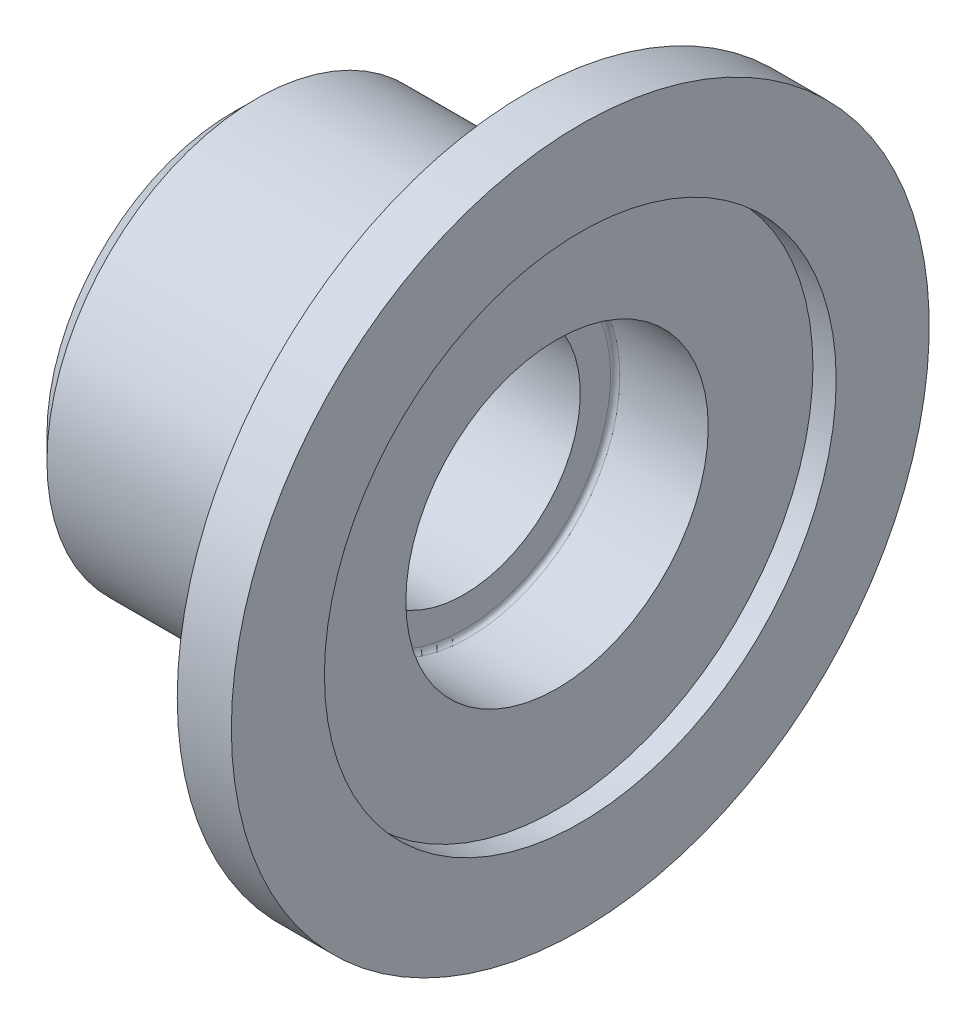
ISO-10303-21;
HEADER;
FILE_DESCRIPTION(('STEP AP214'),'2;1');
FILE_NAME('part.step','',(''),(''),'','','');
FILE_SCHEMA(('AUTOMOTIVE_DESIGN { 1 0 10303 214 1 1 1 1 }'));
ENDSEC;
DATA;
#1=APPLICATION_CONTEXT('core data for automotive mechanical design processes');
#2=APPLICATION_PROTOCOL_DEFINITION('international standard','automotive_design',2000,#1);
#3=PRODUCT_CONTEXT('',#1,'mechanical');
#4=PRODUCT('Part','Part','',(#3));
#5=PRODUCT_RELATED_PRODUCT_CATEGORY('part','',(#4));
#6=PRODUCT_DEFINITION_FORMATION('','',#4);
#7=PRODUCT_DEFINITION_CONTEXT('part definition',#1,'design');
#8=PRODUCT_DEFINITION('design','',#6,#7);
#9=PRODUCT_DEFINITION_SHAPE('','',#8);
#10=(LENGTH_UNIT() NAMED_UNIT(*) SI_UNIT(.MILLI.,.METRE.));
#11=(NAMED_UNIT(*) PLANE_ANGLE_UNIT() SI_UNIT($,.RADIAN.));
#12=(NAMED_UNIT(*) SI_UNIT($,.STERADIAN.) SOLID_ANGLE_UNIT());
#13=UNCERTAINTY_MEASURE_WITH_UNIT(LENGTH_MEASURE(1.E-05),#10,'distance_accuracy_value','');
#14=(GEOMETRIC_REPRESENTATION_CONTEXT(3) GLOBAL_UNCERTAINTY_ASSIGNED_CONTEXT((#13)) GLOBAL_UNIT_ASSIGNED_CONTEXT((#10,
#11,#12)) REPRESENTATION_CONTEXT('',''));
#15=CARTESIAN_POINT('',(0.,0.,0.));
#16=DIRECTION('',(0.,0.,1.));
#17=DIRECTION('',(1.,0.,0.));
#18=AXIS2_PLACEMENT_3D('',#15,#16,#17);
#19=CARTESIAN_POINT('',(56.0843738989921,0.,0.));
#20=DIRECTION('',(-1.,0.,0.));
#21=DIRECTION('',(0.,0.,1.));
#22=AXIS2_PLACEMENT_3D('',#19,#20,#21);
#23=TOROIDAL_SURFACE('',#22,31.4999999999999,0.999999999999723);
#24=CARTESIAN_POINT('',(55.0843738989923,0.,0.));
#25=DIRECTION('',(-1.,0.,0.));
#26=DIRECTION('',(0.,0.,1.));
#27=AXIS2_PLACEMENT_3D('',#24,#25,#26);
#28=CIRCLE('',#27,31.4999999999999);
#29=CARTESIAN_POINT('',(55.0843738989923,0.,31.4999999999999));
#30=VERTEX_POINT('',#29);
#31=EDGE_CURVE('E82',#30,#30,#28,.T.);
#32=ORIENTED_EDGE('',*,*,#31,.T.);
#33=EDGE_LOOP('',(#32));
#34=FACE_BOUND('',#33,.T.);
#35=CARTESIAN_POINT('',(56.0843738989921,0.,0.));
#36=DIRECTION('',(-1.,0.,0.));
#37=DIRECTION('',(0.,0.,1.));
#38=AXIS2_PLACEMENT_3D('',#35,#36,#37);
#39=CIRCLE('',#38,32.4999999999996);
#40=CARTESIAN_POINT('',(56.0843738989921,0.,32.4999999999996));
#41=VERTEX_POINT('',#40);
#42=EDGE_CURVE('E10',#41,#41,#39,.T.);
#43=ORIENTED_EDGE('',*,*,#42,.F.);
#44=EDGE_LOOP('',(#43));
#45=FACE_BOUND('',#44,.T.);
#46=ADVANCED_FACE('F33',(#34,#45),#23,.F.);
#47=CARTESIAN_POINT('',(0.,0.,0.));
#48=DIRECTION('',(-1.,0.,0.));
#49=DIRECTION('',(0.,0.,1.));
#50=AXIS2_PLACEMENT_3D('',#47,#48,#49);
#51=CYLINDRICAL_SURFACE('',#50,32.4999999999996);
#52=CARTESIAN_POINT('',(75.0843738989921,0.,0.));
#53=DIRECTION('',(-1.,0.,0.));
#54=DIRECTION('',(0.,0.,1.));
#55=AXIS2_PLACEMENT_3D('',#52,#53,#54);
#56=CIRCLE('',#55,32.4999999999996);
#57=CARTESIAN_POINT('',(75.0843738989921,0.,32.4999999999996));
#58=VERTEX_POINT('',#57);
#59=EDGE_CURVE('E39',#58,#58,#56,.T.);
#60=ORIENTED_EDGE('',*,*,#59,.F.);
#61=EDGE_LOOP('',(#60));
#62=FACE_BOUND('',#61,.T.);
#63=ORIENTED_EDGE('',*,*,#42,.T.);
#64=EDGE_LOOP('',(#63));
#65=FACE_BOUND('',#64,.T.);
#66=ADVANCED_FACE('F106',(#62,#65),#51,.F.);
#67=CARTESIAN_POINT('',(75.0843738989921,-29.2163034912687,0.));
#68=DIRECTION('',(-1.,0.,0.));
#69=DIRECTION('',(0.,0.,1.));
#70=AXIS2_PLACEMENT_3D('',#67,#68,#69);
#71=PLANE('',#70);
#72=CARTESIAN_POINT('',(75.0843738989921,0.,0.));
#73=DIRECTION('',(-1.,0.,0.));
#74=DIRECTION('',(0.,0.,1.));
#75=AXIS2_PLACEMENT_3D('',#72,#73,#74);
#76=CIRCLE('',#75,54.9999999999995);
#77=CARTESIAN_POINT('',(75.0843738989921,0.,54.9999999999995));
#78=VERTEX_POINT('',#77);
#79=EDGE_CURVE('E43',#78,#78,#76,.T.);
#80=ORIENTED_EDGE('',*,*,#79,.F.);
#81=EDGE_LOOP('',(#80));
#82=FACE_BOUND('',#81,.T.);
#83=ORIENTED_EDGE('',*,*,#59,.T.);
#84=EDGE_LOOP('',(#83));
#85=FACE_BOUND('',#84,.T.);
#86=ADVANCED_FACE('F110',(#82,#85),#71,.F.);
#87=CARTESIAN_POINT('',(0.,0.,0.));
#88=DIRECTION('',(-1.,0.,0.));
#89=DIRECTION('',(0.,0.,1.));
#90=AXIS2_PLACEMENT_3D('',#87,#88,#89);
#91=CYLINDRICAL_SURFACE('',#90,54.9999999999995);
#92=CARTESIAN_POINT('',(80.0843738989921,0.,0.));
#93=DIRECTION('',(-1.,0.,0.));
#94=DIRECTION('',(0.,0.,1.));
#95=AXIS2_PLACEMENT_3D('',#92,#93,#94);
#96=CIRCLE('',#95,54.9999999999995);
#97=CARTESIAN_POINT('',(80.0843738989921,0.,54.9999999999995));
#98=VERTEX_POINT('',#97);
#99=EDGE_CURVE('E47',#98,#98,#96,.T.);
#100=ORIENTED_EDGE('',*,*,#99,.F.);
#101=EDGE_LOOP('',(#100));
#102=FACE_BOUND('',#101,.T.);
#103=ORIENTED_EDGE('',*,*,#79,.T.);
#104=EDGE_LOOP('',(#103));
#105=FACE_BOUND('',#104,.T.);
#106=ADVANCED_FACE('F115',(#102,#105),#91,.F.);
#107=CARTESIAN_POINT('',(80.0843738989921,-29.2163034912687,0.));
#108=DIRECTION('',(-1.,0.,0.));
#109=DIRECTION('',(0.,0.,1.));
#110=AXIS2_PLACEMENT_3D('',#107,#108,#109);
#111=PLANE('',#110);
#112=CARTESIAN_POINT('',(80.0843738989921,0.,0.));
#113=DIRECTION('',(-1.,0.,0.));
#114=DIRECTION('',(0.,0.,1.));
#115=AXIS2_PLACEMENT_3D('',#112,#113,#114);
#116=CIRCLE('',#115,74.9999999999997);
#117=CARTESIAN_POINT('',(80.0843738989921,0.,74.9999999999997));
#118=VERTEX_POINT('',#117);
#119=EDGE_CURVE('E52',#118,#118,#116,.T.);
#120=ORIENTED_EDGE('',*,*,#119,.F.);
#121=EDGE_LOOP('',(#120));
#122=FACE_BOUND('',#121,.T.);
#123=ORIENTED_EDGE('',*,*,#99,.T.);
#124=EDGE_LOOP('',(#123));
#125=FACE_BOUND('',#124,.T.);
#126=ADVANCED_FACE('F121',(#122,#125),#111,.F.);
#127=CARTESIAN_POINT('',(0.,0.,0.));
#128=DIRECTION('',(-1.,0.,0.));
#129=DIRECTION('',(0.,0.,1.));
#130=AXIS2_PLACEMENT_3D('',#127,#128,#129);
#131=CYLINDRICAL_SURFACE('',#130,74.9999999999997);
#132=ORIENTED_EDGE('',*,*,#119,.T.);
#133=EDGE_LOOP('',(#132));
#134=FACE_BOUND('',#133,.T.);
#135=CARTESIAN_POINT('',(68.4543738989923,0.,0.));
#136=DIRECTION('',(-1.,0.,0.));
#137=DIRECTION('',(0.,0.,1.));
#138=AXIS2_PLACEMENT_3D('',#135,#136,#137);
#139=CIRCLE('',#138,74.9999999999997);
#140=CARTESIAN_POINT('',(68.4543738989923,0.,74.9999999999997));
#141=VERTEX_POINT('',#140);
#142=EDGE_CURVE('E55',#141,#141,#139,.T.);
#143=ORIENTED_EDGE('',*,*,#142,.F.);
#144=EDGE_LOOP('',(#143));
#145=FACE_BOUND('',#144,.T.);
#146=ADVANCED_FACE('F125',(#134,#145),#131,.T.);
#147=CARTESIAN_POINT('',(68.4543738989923,-29.2163034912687,0.));
#148=DIRECTION('',(-1.,0.,0.));
#149=DIRECTION('',(0.,0.,1.));
#150=AXIS2_PLACEMENT_3D('',#147,#148,#149);
#151=PLANE('',#150);
#152=ORIENTED_EDGE('',*,*,#142,.T.);
#153=EDGE_LOOP('',(#152));
#154=FACE_BOUND('',#153,.T.);
#155=CARTESIAN_POINT('',(68.4543738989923,0.,0.));
#156=DIRECTION('',(-1.,0.,0.));
#157=DIRECTION('',(0.,0.,1.));
#158=AXIS2_PLACEMENT_3D('',#155,#156,#157);
#159=CIRCLE('',#158,49.9999999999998);
#160=CARTESIAN_POINT('',(68.4543738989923,0.,49.9999999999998));
#161=VERTEX_POINT('',#160);
#162=EDGE_CURVE('E58',#161,#161,#159,.T.);
#163=ORIENTED_EDGE('',*,*,#162,.F.);
#164=EDGE_LOOP('',(#163));
#165=FACE_BOUND('',#164,.T.);
#166=ADVANCED_FACE('F129',(#154,#165),#151,.T.);
#167=CARTESIAN_POINT('',(63.4543738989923,0.,0.));
#168=DIRECTION('',(-1.,0.,0.));
#169=DIRECTION('',(0.,0.,1.));
#170=AXIS2_PLACEMENT_3D('',#167,#168,#169);
#171=TOROIDAL_SURFACE('',#170,49.9999999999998,4.99999999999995);
#172=ORIENTED_EDGE('',*,*,#162,.T.);
#173=EDGE_LOOP('',(#172));
#174=FACE_BOUND('',#173,.T.);
#175=CARTESIAN_POINT('',(63.4543738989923,0.,0.));
#176=DIRECTION('',(-1.,0.,0.));
#177=DIRECTION('',(0.,0.,1.));
#178=AXIS2_PLACEMENT_3D('',#175,#176,#177);
#179=CIRCLE('',#178,44.9999999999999);
#180=CARTESIAN_POINT('',(63.4543738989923,0.,44.9999999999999));
#181=VERTEX_POINT('',#180);
#182=EDGE_CURVE('E61',#181,#181,#179,.T.);
#183=ORIENTED_EDGE('',*,*,#182,.F.);
#184=EDGE_LOOP('',(#183));
#185=FACE_BOUND('',#184,.T.);
#186=ADVANCED_FACE('F133',(#174,#185),#171,.F.);
#187=CARTESIAN_POINT('',(0.,0.,0.));
#188=DIRECTION('',(-1.,0.,0.));
#189=DIRECTION('',(0.,0.,1.));
#190=AXIS2_PLACEMENT_3D('',#187,#188,#189);
#191=CYLINDRICAL_SURFACE('',#190,44.9999999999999);
#192=ORIENTED_EDGE('',*,*,#182,.T.);
#193=EDGE_LOOP('',(#192));
#194=FACE_BOUND('',#193,.T.);
#195=CARTESIAN_POINT('',(10.4543738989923,0.,0.));
#196=DIRECTION('',(-1.,0.,0.));
#197=DIRECTION('',(0.,0.,1.));
#198=AXIS2_PLACEMENT_3D('',#195,#196,#197);
#199=CIRCLE('',#198,44.9999999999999);
#200=CARTESIAN_POINT('',(10.4543738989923,0.,44.9999999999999));
#201=VERTEX_POINT('',#200);
#202=EDGE_CURVE('E64',#201,#201,#199,.T.);
#203=ORIENTED_EDGE('',*,*,#202,.F.);
#204=EDGE_LOOP('',(#203));
#205=FACE_BOUND('',#204,.T.);
#206=ADVANCED_FACE('F137',(#194,#205),#191,.T.);
#207=CARTESIAN_POINT('',(10.4543738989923,0.,0.));
#208=DIRECTION('',(1.,0.,0.));
#209=DIRECTION('',(0.,0.,-1.));
#210=AXIS2_PLACEMENT_3D('',#207,#208,#209);
#211=CONICAL_SURFACE('',#210,44.9999999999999,0.785398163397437);
#212=CARTESIAN_POINT('',(5.45437389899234,0.,0.));
#213=DIRECTION('',(-1.,0.,0.));
#214=DIRECTION('',(0.,0.,1.));
#215=AXIS2_PLACEMENT_3D('',#212,#213,#214);
#216=CIRCLE('',#215,40.0000000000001);
#217=CARTESIAN_POINT('',(5.45437389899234,0.,40.0000000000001));
#218=VERTEX_POINT('',#217);
#219=EDGE_CURVE('E67',#218,#218,#216,.T.);
#220=ORIENTED_EDGE('',*,*,#219,.F.);
#221=EDGE_LOOP('',(#220));
#222=FACE_BOUND('',#221,.T.);
#223=ORIENTED_EDGE('',*,*,#202,.T.);
#224=EDGE_LOOP('',(#223));
#225=FACE_BOUND('',#224,.T.);
#226=ADVANCED_FACE('F141',(#222,#225),#211,.T.);
#227=CARTESIAN_POINT('',(5.45437389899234,-29.2163034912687,0.));
#228=DIRECTION('',(-1.,0.,0.));
#229=DIRECTION('',(0.,0.,1.));
#230=AXIS2_PLACEMENT_3D('',#227,#228,#229);
#231=PLANE('',#230);
#232=ORIENTED_EDGE('',*,*,#219,.T.);
#233=EDGE_LOOP('',(#232));
#234=FACE_BOUND('',#233,.T.);
#235=CARTESIAN_POINT('',(5.45437389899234,0.,0.));
#236=DIRECTION('',(-1.,0.,0.));
#237=DIRECTION('',(0.,0.,1.));
#238=AXIS2_PLACEMENT_3D('',#235,#236,#237);
#239=CIRCLE('',#238,25.9999999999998);
#240=CARTESIAN_POINT('',(5.45437389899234,0.,25.9999999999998));
#241=VERTEX_POINT('',#240);
#242=EDGE_CURVE('E70',#241,#241,#239,.T.);
#243=ORIENTED_EDGE('',*,*,#242,.F.);
#244=EDGE_LOOP('',(#243));
#245=FACE_BOUND('',#244,.T.);
#246=ADVANCED_FACE('F145',(#234,#245),#231,.T.);
#247=CARTESIAN_POINT('',(0.,0.,0.));
#248=DIRECTION('',(-1.,0.,0.));
#249=DIRECTION('',(0.,0.,1.));
#250=AXIS2_PLACEMENT_3D('',#247,#248,#249);
#251=CYLINDRICAL_SURFACE('',#250,25.9999999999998);
#252=ORIENTED_EDGE('',*,*,#242,.T.);
#253=EDGE_LOOP('',(#252));
#254=FACE_BOUND('',#253,.T.);
#255=CARTESIAN_POINT('',(9.45437389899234,0.,0.));
#256=DIRECTION('',(-1.,0.,0.));
#257=DIRECTION('',(0.,0.,1.));
#258=AXIS2_PLACEMENT_3D('',#255,#256,#257);
#259=CIRCLE('',#258,25.9999999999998);
#260=CARTESIAN_POINT('',(9.45437389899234,0.,25.9999999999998));
#261=VERTEX_POINT('',#260);
#262=EDGE_CURVE('E73',#261,#261,#259,.T.);
#263=ORIENTED_EDGE('',*,*,#262,.F.);
#264=EDGE_LOOP('',(#263));
#265=FACE_BOUND('',#264,.T.);
#266=ADVANCED_FACE('F102',(#254,#265),#251,.F.);
#267=CARTESIAN_POINT('',(9.45437389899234,0.,0.));
#268=DIRECTION('',(-1.,0.,0.));
#269=DIRECTION('',(0.,0.,1.));
#270=AXIS2_PLACEMENT_3D('',#267,#268,#269);
#271=CONICAL_SURFACE('',#270,25.9999999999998,0.785398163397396);
#272=CARTESIAN_POINT('',(10.4543738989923,0.,0.));
#273=DIRECTION('',(-1.,0.,0.));
#274=DIRECTION('',(0.,0.,1.));
#275=AXIS2_PLACEMENT_3D('',#272,#273,#274);
#276=CIRCLE('',#275,24.9999999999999);
#277=CARTESIAN_POINT('',(10.4543738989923,0.,24.9999999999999));
#278=VERTEX_POINT('',#277);
#279=EDGE_CURVE('E76',#278,#278,#276,.T.);
#280=ORIENTED_EDGE('',*,*,#279,.F.);
#281=EDGE_LOOP('',(#280));
#282=FACE_BOUND('',#281,.T.);
#283=ORIENTED_EDGE('',*,*,#262,.T.);
#284=EDGE_LOOP('',(#283));
#285=FACE_BOUND('',#284,.T.);
#286=ADVANCED_FACE('F96',(#282,#285),#271,.F.);
#287=CARTESIAN_POINT('',(0.,0.,0.));
#288=DIRECTION('',(-1.,0.,0.));
#289=DIRECTION('',(0.,0.,1.));
#290=AXIS2_PLACEMENT_3D('',#287,#288,#289);
#291=CYLINDRICAL_SURFACE('',#290,24.9999999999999);
#292=ORIENTED_EDGE('',*,*,#279,.T.);
#293=EDGE_LOOP('',(#292));
#294=FACE_BOUND('',#293,.T.);
#295=CARTESIAN_POINT('',(55.0843738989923,0.,0.));
#296=DIRECTION('',(-1.,0.,0.));
#297=DIRECTION('',(0.,0.,1.));
#298=AXIS2_PLACEMENT_3D('',#295,#296,#297);
#299=CIRCLE('',#298,24.9999999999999);
#300=CARTESIAN_POINT('',(55.0843738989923,0.,24.9999999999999));
#301=VERTEX_POINT('',#300);
#302=EDGE_CURVE('E79',#301,#301,#299,.T.);
#303=ORIENTED_EDGE('',*,*,#302,.F.);
#304=EDGE_LOOP('',(#303));
#305=FACE_BOUND('',#304,.T.);
#306=ADVANCED_FACE('F91',(#294,#305),#291,.F.);
#307=CARTESIAN_POINT('',(55.0843738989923,-29.2163034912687,0.));
#308=DIRECTION('',(-1.,0.,0.));
#309=DIRECTION('',(0.,0.,1.));
#310=AXIS2_PLACEMENT_3D('',#307,#308,#309);
#311=PLANE('',#310);
#312=ORIENTED_EDGE('',*,*,#31,.F.);
#313=EDGE_LOOP('',(#312));
#314=FACE_BOUND('',#313,.T.);
#315=ORIENTED_EDGE('',*,*,#302,.T.);
#316=EDGE_LOOP('',(#315));
#317=FACE_BOUND('',#316,.T.);
#318=ADVANCED_FACE('F88',(#314,#317),#311,.F.);
#319=CLOSED_SHELL('',(#46,#66,#86,#106,#126,#146,#166,#186,#206,#226,#246,#266,#286,#306,#318));
#320=MANIFOLD_SOLID_BREP('B2',#319);
#321=ADVANCED_BREP_SHAPE_REPRESENTATION('',(#18,#320),#14);
#322=SHAPE_DEFINITION_REPRESENTATION(#9,#321);
ENDSEC;
END-ISO-10303-21;
